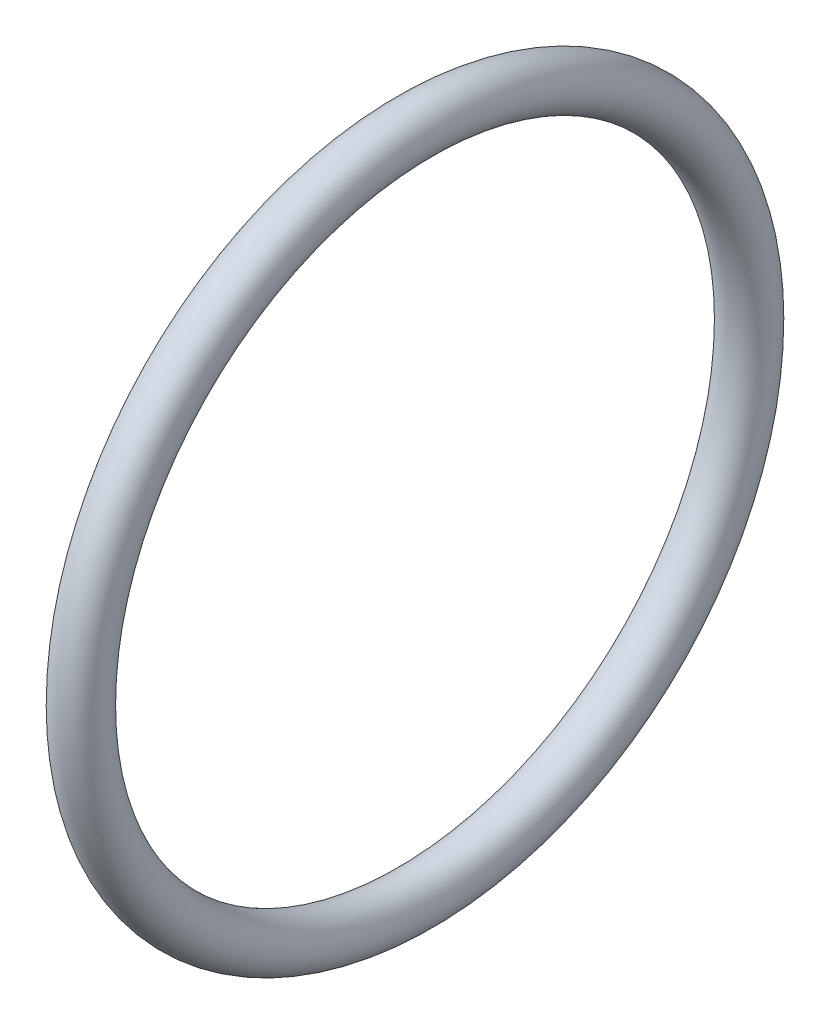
from build123d import *

# Parameters (mm, degrees)
SKETCH1_R = 1.3081


with BuildPart() as part:
    # Sketch1 → Base-Revolve (revolve)
    with BuildSketch(Plane.XY, mode=Mode.PRIVATE) as base_revolve_sk:
        with Locations((0, 17.8054)):
            Circle(SKETCH1_R)
    revolve(base_revolve_sk.sketch.rotate(Axis((0, 0, 0), (1, 0, 0)), 90), axis=Axis((0, 0, 0), (1, 0, 0)))


solid = part.part
